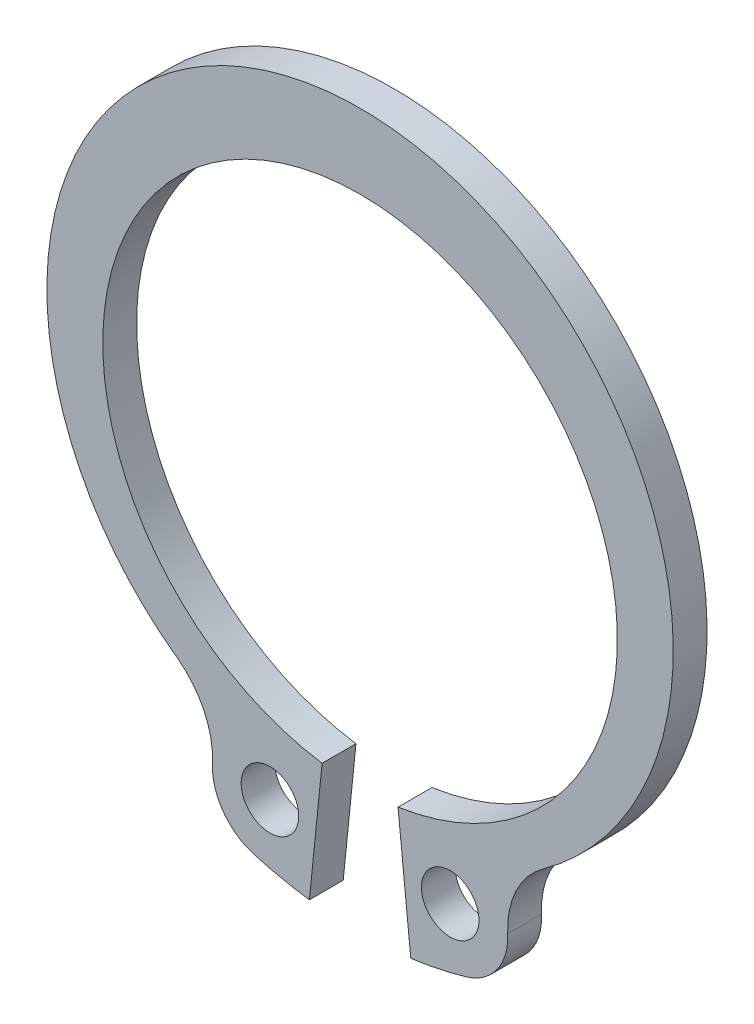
ISO-10303-21;
HEADER;
FILE_DESCRIPTION(('STEP AP214'),'2;1');
FILE_NAME('part.step','',(''),(''),'','','');
FILE_SCHEMA(('AUTOMOTIVE_DESIGN { 1 0 10303 214 1 1 1 1 }'));
ENDSEC;
DATA;
#1=APPLICATION_CONTEXT('core data for automotive mechanical design processes');
#2=APPLICATION_PROTOCOL_DEFINITION('international standard','automotive_design',2000,#1);
#3=PRODUCT_CONTEXT('',#1,'mechanical');
#4=PRODUCT('Part','Part','',(#3));
#5=PRODUCT_RELATED_PRODUCT_CATEGORY('part','',(#4));
#6=PRODUCT_DEFINITION_FORMATION('','',#4);
#7=PRODUCT_DEFINITION_CONTEXT('part definition',#1,'design');
#8=PRODUCT_DEFINITION('design','',#6,#7);
#9=PRODUCT_DEFINITION_SHAPE('','',#8);
#10=(LENGTH_UNIT() NAMED_UNIT(*) SI_UNIT(.MILLI.,.METRE.));
#11=(NAMED_UNIT(*) PLANE_ANGLE_UNIT() SI_UNIT($,.RADIAN.));
#12=(NAMED_UNIT(*) SI_UNIT($,.STERADIAN.) SOLID_ANGLE_UNIT());
#13=UNCERTAINTY_MEASURE_WITH_UNIT(LENGTH_MEASURE(1.E-05),#10,'distance_accuracy_value','');
#14=(GEOMETRIC_REPRESENTATION_CONTEXT(3) GLOBAL_UNCERTAINTY_ASSIGNED_CONTEXT((#13)) GLOBAL_UNIT_ASSIGNED_CONTEXT((#10,
#11,#12)) REPRESENTATION_CONTEXT('',''));
#15=CARTESIAN_POINT('',(0.,0.,0.));
#16=DIRECTION('',(0.,0.,1.));
#17=DIRECTION('',(1.,0.,0.));
#18=AXIS2_PLACEMENT_3D('',#15,#16,#17);
#19=CARTESIAN_POINT('',(0.,0.,1.));
#20=DIRECTION('',(0.,0.,1.));
#21=DIRECTION('',(1.,0.,0.));
#22=AXIS2_PLACEMENT_3D('',#19,#20,#21);
#23=PLANE('',#22);
#24=CARTESIAN_POINT('',(-2.66257201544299,-9.22060539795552,1.));
#25=DIRECTION('',(0.,0.,1.));
#26=DIRECTION('',(-1.,0.,0.));
#27=AXIS2_PLACEMENT_3D('',#24,#25,#26);
#28=CIRCLE('',#27,0.85);
#29=CARTESIAN_POINT('',(-3.51257201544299,-9.22060539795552,1.));
#30=VERTEX_POINT('',#29);
#31=EDGE_CURVE('E154',#30,#30,#28,.T.);
#32=ORIENTED_EDGE('',*,*,#31,.F.);
#33=EDGE_LOOP('',(#32));
#34=FACE_BOUND('',#33,.T.);
#35=CARTESIAN_POINT('',(0.,0.,1.));
#36=DIRECTION('',(0.,0.,-1.));
#37=DIRECTION('',(1.,0.,0.));
#38=AXIS2_PLACEMENT_3D('',#35,#36,#37);
#39=CIRCLE('',#38,7.6);
#40=CARTESIAN_POINT('',(-1.12140989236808,-7.51681048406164,1.));
#41=VERTEX_POINT('',#40);
#42=CARTESIAN_POINT('',(1.12140989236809,-7.51681048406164,1.));
#43=VERTEX_POINT('',#42);
#44=EDGE_CURVE('E169',#41,#43,#39,.T.);
#45=ORIENTED_EDGE('',*,*,#44,.T.);
#46=DIRECTION('',(0.101643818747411,-0.994820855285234,0.));
#47=VECTOR('',#46,1.);
#48=CARTESIAN_POINT('',(1.12140989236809,-7.51681048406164,1.));
#49=LINE('',#48,#47);
#50=CARTESIAN_POINT('',(1.4974920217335,-11.197647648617,1.));
#51=VERTEX_POINT('',#50);
#52=EDGE_CURVE('E107',#43,#51,#49,.T.);
#53=ORIENTED_EDGE('',*,*,#52,.T.);
#54=CARTESIAN_POINT('',(0.,0.,1.));
#55=DIRECTION('',(0.,0.,1.));
#56=DIRECTION('',(1.,0.,0.));
#57=AXIS2_PLACEMENT_3D('',#54,#55,#56);
#58=CIRCLE('',#57,11.297335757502);
#59=CARTESIAN_POINT('',(3.13420003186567,-10.853874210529,1.));
#60=VERTEX_POINT('',#59);
#61=EDGE_CURVE('E190',#51,#60,#58,.T.);
#62=ORIENTED_EDGE('',*,*,#61,.T.);
#63=CARTESIAN_POINT('',(2.662572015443,-9.22060539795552,1.));
#64=DIRECTION('',(0.,0.,1.));
#65=DIRECTION('',(1.,0.,0.));
#66=AXIS2_PLACEMENT_3D('',#63,#64,#65);
#67=CIRCLE('',#66,1.7);
#68=CARTESIAN_POINT('',(4.36061647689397,-9.13908848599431,1.));
#69=VERTEX_POINT('',#68);
#70=EDGE_CURVE('E209',#60,#69,#67,.T.);
#71=ORIENTED_EDGE('',*,*,#70,.T.);
#72=CARTESIAN_POINT('',(6.90768316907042,-9.01681311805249,1.));
#73=DIRECTION('',(0.,0.,-1.));
#74=DIRECTION('',(1.,0.,0.));
#75=AXIS2_PLACEMENT_3D('',#72,#73,#74);
#76=CIRCLE('',#75,2.55);
#77=CARTESIAN_POINT('',(5.41492112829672,-6.94940858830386,1.));
#78=VERTEX_POINT('',#77);
#79=EDGE_CURVE('E206',#69,#78,#76,.T.);
#80=ORIENTED_EDGE('',*,*,#79,.T.);
#81=CARTESIAN_POINT('',(0.,0.55,1.));
#82=DIRECTION('',(0.,0.,1.));
#83=DIRECTION('',(1.,0.,0.));
#84=AXIS2_PLACEMENT_3D('',#81,#82,#83);
#85=CIRCLE('',#84,9.25);
#86=CARTESIAN_POINT('',(-5.41492112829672,-6.94940858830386,1.));
#87=VERTEX_POINT('',#86);
#88=EDGE_CURVE('E208',#78,#87,#85,.T.);
#89=ORIENTED_EDGE('',*,*,#88,.T.);
#90=CARTESIAN_POINT('',(-6.90768316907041,-9.0168131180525,1.));
#91=DIRECTION('',(0.,0.,-1.));
#92=DIRECTION('',(-1.,0.,0.));
#93=AXIS2_PLACEMENT_3D('',#90,#91,#92);
#94=CIRCLE('',#93,2.55);
#95=CARTESIAN_POINT('',(-4.36061647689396,-9.13908848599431,1.));
#96=VERTEX_POINT('',#95);
#97=EDGE_CURVE('E132',#87,#96,#94,.T.);
#98=ORIENTED_EDGE('',*,*,#97,.T.);
#99=CARTESIAN_POINT('',(-2.66257201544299,-9.22060539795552,1.));
#100=DIRECTION('',(0.,0.,1.));
#101=DIRECTION('',(-1.,0.,0.));
#102=AXIS2_PLACEMENT_3D('',#99,#100,#101);
#103=CIRCLE('',#102,1.7);
#104=CARTESIAN_POINT('',(-3.13420003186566,-10.853874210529,1.));
#105=VERTEX_POINT('',#104);
#106=EDGE_CURVE('E126',#96,#105,#103,.T.);
#107=ORIENTED_EDGE('',*,*,#106,.T.);
#108=CARTESIAN_POINT('',(0.,0.,1.));
#109=DIRECTION('',(0.,0.,1.));
#110=DIRECTION('',(-1.,0.,0.));
#111=AXIS2_PLACEMENT_3D('',#108,#109,#110);
#112=CIRCLE('',#111,11.297335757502);
#113=CARTESIAN_POINT('',(-1.4974920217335,-11.197647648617,1.));
#114=VERTEX_POINT('',#113);
#115=EDGE_CURVE('E130',#105,#114,#112,.T.);
#116=ORIENTED_EDGE('',*,*,#115,.T.);
#117=DIRECTION('',(0.101643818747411,0.994820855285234,0.));
#118=VECTOR('',#117,1.);
#119=CARTESIAN_POINT('',(-1.12140989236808,-7.51681048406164,1.));
#120=LINE('',#119,#118);
#121=EDGE_CURVE('E58',#114,#41,#120,.T.);
#122=ORIENTED_EDGE('',*,*,#121,.T.);
#123=EDGE_LOOP('',(#45,#53,#62,#71,#80,#89,#98,#107,#116,#122));
#124=FACE_BOUND('',#123,.T.);
#125=CARTESIAN_POINT('',(2.662572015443,-9.22060539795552,1.));
#126=DIRECTION('',(0.,0.,1.));
#127=DIRECTION('',(1.,0.,0.));
#128=AXIS2_PLACEMENT_3D('',#125,#126,#127);
#129=CIRCLE('',#128,0.85);
#130=CARTESIAN_POINT('',(3.512572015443,-9.22060539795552,1.));
#131=VERTEX_POINT('',#130);
#132=EDGE_CURVE('E220',#131,#131,#129,.T.);
#133=ORIENTED_EDGE('',*,*,#132,.F.);
#134=EDGE_LOOP('',(#133));
#135=FACE_BOUND('',#134,.T.);
#136=ADVANCED_FACE('F41',(#34,#124,#135),#23,.T.);
#137=CARTESIAN_POINT('',(0.,0.,0.));
#138=DIRECTION('',(0.,0.,1.));
#139=DIRECTION('',(1.,0.,0.));
#140=AXIS2_PLACEMENT_3D('',#137,#138,#139);
#141=PLANE('',#140);
#142=CARTESIAN_POINT('',(0.,0.,0.));
#143=DIRECTION('',(0.,0.,-1.));
#144=DIRECTION('',(1.,0.,0.));
#145=AXIS2_PLACEMENT_3D('',#142,#143,#144);
#146=CIRCLE('',#145,7.6);
#147=CARTESIAN_POINT('',(-1.12140989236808,-7.51681048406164,0.));
#148=VERTEX_POINT('',#147);
#149=CARTESIAN_POINT('',(1.12140989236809,-7.51681048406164,0.));
#150=VERTEX_POINT('',#149);
#151=EDGE_CURVE('E150',#148,#150,#146,.T.);
#152=ORIENTED_EDGE('',*,*,#151,.F.);
#153=DIRECTION('',(0.101643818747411,0.994820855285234,0.));
#154=VECTOR('',#153,1.);
#155=CARTESIAN_POINT('',(-1.12140989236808,-7.51681048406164,0.));
#156=LINE('',#155,#154);
#157=CARTESIAN_POINT('',(-1.4974920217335,-11.197647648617,0.));
#158=VERTEX_POINT('',#157);
#159=EDGE_CURVE('E99',#158,#148,#156,.T.);
#160=ORIENTED_EDGE('',*,*,#159,.F.);
#161=CARTESIAN_POINT('',(0.,0.,0.));
#162=DIRECTION('',(0.,0.,1.));
#163=DIRECTION('',(-1.,0.,0.));
#164=AXIS2_PLACEMENT_3D('',#161,#162,#163);
#165=CIRCLE('',#164,11.297335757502);
#166=CARTESIAN_POINT('',(-3.13420003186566,-10.853874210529,0.));
#167=VERTEX_POINT('',#166);
#168=EDGE_CURVE('E93',#167,#158,#165,.T.);
#169=ORIENTED_EDGE('',*,*,#168,.F.);
#170=CARTESIAN_POINT('',(-2.66257201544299,-9.22060539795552,0.));
#171=DIRECTION('',(0.,0.,1.));
#172=DIRECTION('',(-1.,0.,0.));
#173=AXIS2_PLACEMENT_3D('',#170,#171,#172);
#174=CIRCLE('',#173,1.7);
#175=CARTESIAN_POINT('',(-4.36061647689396,-9.13908848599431,0.));
#176=VERTEX_POINT('',#175);
#177=EDGE_CURVE('E140',#176,#167,#174,.T.);
#178=ORIENTED_EDGE('',*,*,#177,.F.);
#179=CARTESIAN_POINT('',(-6.90768316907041,-9.0168131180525,0.));
#180=DIRECTION('',(0.,0.,-1.));
#181=DIRECTION('',(-1.,0.,0.));
#182=AXIS2_PLACEMENT_3D('',#179,#180,#181);
#183=CIRCLE('',#182,2.55);
#184=CARTESIAN_POINT('',(-5.41492112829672,-6.94940858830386,0.));
#185=VERTEX_POINT('',#184);
#186=EDGE_CURVE('E164',#185,#176,#183,.T.);
#187=ORIENTED_EDGE('',*,*,#186,.F.);
#188=CARTESIAN_POINT('',(0.,0.55,0.));
#189=DIRECTION('',(0.,0.,1.));
#190=DIRECTION('',(1.,0.,0.));
#191=AXIS2_PLACEMENT_3D('',#188,#189,#190);
#192=CIRCLE('',#191,9.25);
#193=CARTESIAN_POINT('',(5.41492112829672,-6.94940858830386,0.));
#194=VERTEX_POINT('',#193);
#195=EDGE_CURVE('E162',#194,#185,#192,.T.);
#196=ORIENTED_EDGE('',*,*,#195,.F.);
#197=CARTESIAN_POINT('',(6.90768316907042,-9.01681311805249,0.));
#198=DIRECTION('',(0.,0.,-1.));
#199=DIRECTION('',(1.,0.,0.));
#200=AXIS2_PLACEMENT_3D('',#197,#198,#199);
#201=CIRCLE('',#200,2.55);
#202=CARTESIAN_POINT('',(4.36061647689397,-9.13908848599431,0.));
#203=VERTEX_POINT('',#202);
#204=EDGE_CURVE('E160',#203,#194,#201,.T.);
#205=ORIENTED_EDGE('',*,*,#204,.F.);
#206=CARTESIAN_POINT('',(2.662572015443,-9.22060539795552,0.));
#207=DIRECTION('',(0.,0.,1.));
#208=DIRECTION('',(1.,0.,0.));
#209=AXIS2_PLACEMENT_3D('',#206,#207,#208);
#210=CIRCLE('',#209,1.7);
#211=CARTESIAN_POINT('',(3.13420003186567,-10.853874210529,0.));
#212=VERTEX_POINT('',#211);
#213=EDGE_CURVE('E158',#212,#203,#210,.T.);
#214=ORIENTED_EDGE('',*,*,#213,.F.);
#215=CARTESIAN_POINT('',(0.,0.,0.));
#216=DIRECTION('',(0.,0.,1.));
#217=DIRECTION('',(1.,0.,0.));
#218=AXIS2_PLACEMENT_3D('',#215,#216,#217);
#219=CIRCLE('',#218,11.297335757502);
#220=CARTESIAN_POINT('',(1.4974920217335,-11.197647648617,0.));
#221=VERTEX_POINT('',#220);
#222=EDGE_CURVE('E156',#221,#212,#219,.T.);
#223=ORIENTED_EDGE('',*,*,#222,.F.);
#224=DIRECTION('',(0.101643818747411,-0.994820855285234,0.));
#225=VECTOR('',#224,1.);
#226=CARTESIAN_POINT('',(1.12140989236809,-7.51681048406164,0.));
#227=LINE('',#226,#225);
#228=EDGE_CURVE('E153',#150,#221,#227,.T.);
#229=ORIENTED_EDGE('',*,*,#228,.F.);
#230=EDGE_LOOP('',(#152,#160,#169,#178,#187,#196,#205,#214,#223,#229));
#231=FACE_BOUND('',#230,.T.);
#232=CARTESIAN_POINT('',(-2.66257201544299,-9.22060539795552,0.));
#233=DIRECTION('',(0.,0.,1.));
#234=DIRECTION('',(-1.,0.,0.));
#235=AXIS2_PLACEMENT_3D('',#232,#233,#234);
#236=CIRCLE('',#235,0.85);
#237=CARTESIAN_POINT('',(-3.51257201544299,-9.22060539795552,0.));
#238=VERTEX_POINT('',#237);
#239=EDGE_CURVE('E217',#238,#238,#236,.T.);
#240=ORIENTED_EDGE('',*,*,#239,.T.);
#241=EDGE_LOOP('',(#240));
#242=FACE_BOUND('',#241,.T.);
#243=CARTESIAN_POINT('',(2.662572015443,-9.22060539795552,0.));
#244=DIRECTION('',(0.,0.,1.));
#245=DIRECTION('',(1.,0.,0.));
#246=AXIS2_PLACEMENT_3D('',#243,#244,#245);
#247=CIRCLE('',#246,0.85);
#248=CARTESIAN_POINT('',(3.512572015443,-9.22060539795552,0.));
#249=VERTEX_POINT('',#248);
#250=EDGE_CURVE('E223',#249,#249,#247,.T.);
#251=ORIENTED_EDGE('',*,*,#250,.T.);
#252=EDGE_LOOP('',(#251));
#253=FACE_BOUND('',#252,.T.);
#254=ADVANCED_FACE('F194',(#231,#242,#253),#141,.F.);
#255=CARTESIAN_POINT('',(0.,0.,1.));
#256=DIRECTION('',(0.,0.,-1.));
#257=DIRECTION('',(-1.,0.,0.));
#258=AXIS2_PLACEMENT_3D('',#255,#256,#257);
#259=CYLINDRICAL_SURFACE('',#258,7.6);
#260=ORIENTED_EDGE('',*,*,#151,.T.);
#261=DIRECTION('',(0.,0.,-1.));
#262=VECTOR('',#261,1.);
#263=CARTESIAN_POINT('',(1.12140989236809,-7.51681048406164,1.));
#264=LINE('',#263,#262);
#265=EDGE_CURVE('E11',#43,#150,#264,.T.);
#266=ORIENTED_EDGE('',*,*,#265,.F.);
#267=ORIENTED_EDGE('',*,*,#44,.F.);
#268=DIRECTION('',(0.,0.,-1.));
#269=VECTOR('',#268,1.);
#270=CARTESIAN_POINT('',(-1.12140989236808,-7.51681048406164,1.));
#271=LINE('',#270,#269);
#272=EDGE_CURVE('E146',#41,#148,#271,.T.);
#273=ORIENTED_EDGE('',*,*,#272,.T.);
#274=EDGE_LOOP('',(#260,#266,#267,#273));
#275=FACE_BOUND('',#274,.T.);
#276=ADVANCED_FACE('F43',(#275),#259,.F.);
#277=CARTESIAN_POINT('',(1.12140989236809,-7.51681048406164,1.));
#278=DIRECTION('',(0.994820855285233,0.101643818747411,0.));
#279=DIRECTION('',(-0.101643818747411,0.994820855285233,0.));
#280=AXIS2_PLACEMENT_3D('',#277,#278,#279);
#281=PLANE('',#280);
#282=ORIENTED_EDGE('',*,*,#228,.T.);
#283=DIRECTION('',(0.,0.,-1.));
#284=VECTOR('',#283,1.);
#285=CARTESIAN_POINT('',(1.4974920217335,-11.197647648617,1.));
#286=LINE('',#285,#284);
#287=EDGE_CURVE('E50',#51,#221,#286,.T.);
#288=ORIENTED_EDGE('',*,*,#287,.F.);
#289=ORIENTED_EDGE('',*,*,#52,.F.);
#290=ORIENTED_EDGE('',*,*,#265,.T.);
#291=EDGE_LOOP('',(#282,#288,#289,#290));
#292=FACE_BOUND('',#291,.T.);
#293=ADVANCED_FACE('F263',(#292),#281,.F.);
#294=CARTESIAN_POINT('',(0.,0.,1.));
#295=DIRECTION('',(0.,0.,-1.));
#296=DIRECTION('',(-1.,0.,0.));
#297=AXIS2_PLACEMENT_3D('',#294,#295,#296);
#298=CYLINDRICAL_SURFACE('',#297,11.297335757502);
#299=ORIENTED_EDGE('',*,*,#222,.T.);
#300=DIRECTION('',(0.,0.,-1.));
#301=VECTOR('',#300,1.);
#302=CARTESIAN_POINT('',(3.13420003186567,-10.853874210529,1.));
#303=LINE('',#302,#301);
#304=EDGE_CURVE('E182',#60,#212,#303,.T.);
#305=ORIENTED_EDGE('',*,*,#304,.F.);
#306=ORIENTED_EDGE('',*,*,#61,.F.);
#307=ORIENTED_EDGE('',*,*,#287,.T.);
#308=EDGE_LOOP('',(#299,#305,#306,#307));
#309=FACE_BOUND('',#308,.T.);
#310=ADVANCED_FACE('F188',(#309),#298,.T.);
#311=CARTESIAN_POINT('',(2.662572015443,-9.22060539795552,1.));
#312=DIRECTION('',(0.,0.,-1.));
#313=DIRECTION('',(-1.,0.,0.));
#314=AXIS2_PLACEMENT_3D('',#311,#312,#313);
#315=CYLINDRICAL_SURFACE('',#314,1.7);
#316=ORIENTED_EDGE('',*,*,#213,.T.);
#317=DIRECTION('',(0.,0.,-1.));
#318=VECTOR('',#317,1.);
#319=CARTESIAN_POINT('',(4.36061647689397,-9.13908848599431,1.));
#320=LINE('',#319,#318);
#321=EDGE_CURVE('E179',#69,#203,#320,.T.);
#322=ORIENTED_EDGE('',*,*,#321,.F.);
#323=ORIENTED_EDGE('',*,*,#70,.F.);
#324=ORIENTED_EDGE('',*,*,#304,.T.);
#325=EDGE_LOOP('',(#316,#322,#323,#324));
#326=FACE_BOUND('',#325,.T.);
#327=ADVANCED_FACE('F200',(#326),#315,.T.);
#328=CARTESIAN_POINT('',(6.90768316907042,-9.01681311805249,1.));
#329=DIRECTION('',(0.,0.,-1.));
#330=DIRECTION('',(-1.,0.,0.));
#331=AXIS2_PLACEMENT_3D('',#328,#329,#330);
#332=CYLINDRICAL_SURFACE('',#331,2.55);
#333=ORIENTED_EDGE('',*,*,#204,.T.);
#334=DIRECTION('',(0.,0.,-1.));
#335=VECTOR('',#334,1.);
#336=CARTESIAN_POINT('',(5.41492112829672,-6.94940858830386,1.));
#337=LINE('',#336,#335);
#338=EDGE_CURVE('E176',#78,#194,#337,.T.);
#339=ORIENTED_EDGE('',*,*,#338,.F.);
#340=ORIENTED_EDGE('',*,*,#79,.F.);
#341=ORIENTED_EDGE('',*,*,#321,.T.);
#342=EDGE_LOOP('',(#333,#339,#340,#341));
#343=FACE_BOUND('',#342,.T.);
#344=ADVANCED_FACE('F204',(#343),#332,.F.);
#345=CARTESIAN_POINT('',(0.,0.55,1.));
#346=DIRECTION('',(0.,0.,-1.));
#347=DIRECTION('',(-1.,0.,0.));
#348=AXIS2_PLACEMENT_3D('',#345,#346,#347);
#349=CYLINDRICAL_SURFACE('',#348,9.25);
#350=ORIENTED_EDGE('',*,*,#195,.T.);
#351=DIRECTION('',(0.,0.,-1.));
#352=VECTOR('',#351,1.);
#353=CARTESIAN_POINT('',(-5.41492112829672,-6.94940858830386,1.));
#354=LINE('',#353,#352);
#355=EDGE_CURVE('E173',#87,#185,#354,.T.);
#356=ORIENTED_EDGE('',*,*,#355,.F.);
#357=ORIENTED_EDGE('',*,*,#88,.F.);
#358=ORIENTED_EDGE('',*,*,#338,.T.);
#359=EDGE_LOOP('',(#350,#356,#357,#358));
#360=FACE_BOUND('',#359,.T.);
#361=ADVANCED_FACE('F253',(#360),#349,.T.);
#362=CARTESIAN_POINT('',(-6.90768316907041,-9.0168131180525,1.));
#363=DIRECTION('',(0.,0.,-1.));
#364=DIRECTION('',(-1.,0.,0.));
#365=AXIS2_PLACEMENT_3D('',#362,#363,#364);
#366=CYLINDRICAL_SURFACE('',#365,2.55);
#367=ORIENTED_EDGE('',*,*,#186,.T.);
#368=DIRECTION('',(0.,0.,-1.));
#369=VECTOR('',#368,1.);
#370=CARTESIAN_POINT('',(-4.36061647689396,-9.13908848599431,1.));
#371=LINE('',#370,#369);
#372=EDGE_CURVE('E141',#96,#176,#371,.T.);
#373=ORIENTED_EDGE('',*,*,#372,.F.);
#374=ORIENTED_EDGE('',*,*,#97,.F.);
#375=ORIENTED_EDGE('',*,*,#355,.T.);
#376=EDGE_LOOP('',(#367,#373,#374,#375));
#377=FACE_BOUND('',#376,.T.);
#378=ADVANCED_FACE('F250',(#377),#366,.F.);
#379=CARTESIAN_POINT('',(-2.66257201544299,-9.22060539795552,1.));
#380=DIRECTION('',(0.,0.,-1.));
#381=DIRECTION('',(-1.,0.,0.));
#382=AXIS2_PLACEMENT_3D('',#379,#380,#381);
#383=CYLINDRICAL_SURFACE('',#382,1.7);
#384=ORIENTED_EDGE('',*,*,#177,.T.);
#385=DIRECTION('',(0.,0.,-1.));
#386=VECTOR('',#385,1.);
#387=CARTESIAN_POINT('',(-3.13420003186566,-10.853874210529,1.));
#388=LINE('',#387,#386);
#389=EDGE_CURVE('E137',#105,#167,#388,.T.);
#390=ORIENTED_EDGE('',*,*,#389,.F.);
#391=ORIENTED_EDGE('',*,*,#106,.F.);
#392=ORIENTED_EDGE('',*,*,#372,.T.);
#393=EDGE_LOOP('',(#384,#390,#391,#392));
#394=FACE_BOUND('',#393,.T.);
#395=ADVANCED_FACE('F138',(#394),#383,.T.);
#396=CARTESIAN_POINT('',(0.,0.,1.));
#397=DIRECTION('',(0.,0.,-1.));
#398=DIRECTION('',(-1.,0.,0.));
#399=AXIS2_PLACEMENT_3D('',#396,#397,#398);
#400=CYLINDRICAL_SURFACE('',#399,11.297335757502);
#401=ORIENTED_EDGE('',*,*,#168,.T.);
#402=DIRECTION('',(0.,0.,-1.));
#403=VECTOR('',#402,1.);
#404=CARTESIAN_POINT('',(-1.4974920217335,-11.197647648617,1.));
#405=LINE('',#404,#403);
#406=EDGE_CURVE('E142',#114,#158,#405,.T.);
#407=ORIENTED_EDGE('',*,*,#406,.F.);
#408=ORIENTED_EDGE('',*,*,#115,.F.);
#409=ORIENTED_EDGE('',*,*,#389,.T.);
#410=EDGE_LOOP('',(#401,#407,#408,#409));
#411=FACE_BOUND('',#410,.T.);
#412=ADVANCED_FACE('F144',(#411),#400,.T.);
#413=CARTESIAN_POINT('',(-1.12140989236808,-7.51681048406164,1.));
#414=DIRECTION('',(-0.994820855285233,0.101643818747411,0.));
#415=DIRECTION('',(-0.101643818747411,-0.994820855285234,0.));
#416=AXIS2_PLACEMENT_3D('',#413,#414,#415);
#417=PLANE('',#416);
#418=ORIENTED_EDGE('',*,*,#159,.T.);
#419=ORIENTED_EDGE('',*,*,#272,.F.);
#420=ORIENTED_EDGE('',*,*,#121,.F.);
#421=ORIENTED_EDGE('',*,*,#406,.T.);
#422=EDGE_LOOP('',(#418,#419,#420,#421));
#423=FACE_BOUND('',#422,.T.);
#424=ADVANCED_FACE('F243',(#423),#417,.F.);
#425=CARTESIAN_POINT('',(-2.66257201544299,-9.22060539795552,1.));
#426=DIRECTION('',(0.,0.,-1.));
#427=DIRECTION('',(-1.,0.,0.));
#428=AXIS2_PLACEMENT_3D('',#425,#426,#427);
#429=CYLINDRICAL_SURFACE('',#428,0.85);
#430=ORIENTED_EDGE('',*,*,#31,.T.);
#431=EDGE_LOOP('',(#430));
#432=FACE_BOUND('',#431,.T.);
#433=ORIENTED_EDGE('',*,*,#239,.F.);
#434=EDGE_LOOP('',(#433));
#435=FACE_BOUND('',#434,.T.);
#436=ADVANCED_FACE('F240',(#432,#435),#429,.F.);
#437=CARTESIAN_POINT('',(2.662572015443,-9.22060539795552,1.));
#438=DIRECTION('',(0.,0.,-1.));
#439=DIRECTION('',(-1.,0.,0.));
#440=AXIS2_PLACEMENT_3D('',#437,#438,#439);
#441=CYLINDRICAL_SURFACE('',#440,0.85);
#442=ORIENTED_EDGE('',*,*,#132,.T.);
#443=EDGE_LOOP('',(#442));
#444=FACE_BOUND('',#443,.T.);
#445=ORIENTED_EDGE('',*,*,#250,.F.);
#446=EDGE_LOOP('',(#445));
#447=FACE_BOUND('',#446,.T.);
#448=ADVANCED_FACE('F229',(#444,#447),#441,.F.);
#449=CLOSED_SHELL('',(#136,#254,#276,#293,#310,#327,#344,#361,#378,#395,#412,#424,#436,#448));
#450=MANIFOLD_SOLID_BREP('B2',#449);
#451=ADVANCED_BREP_SHAPE_REPRESENTATION('',(#18,#450),#14);
#452=SHAPE_DEFINITION_REPRESENTATION(#9,#451);
ENDSEC;
END-ISO-10303-21;
